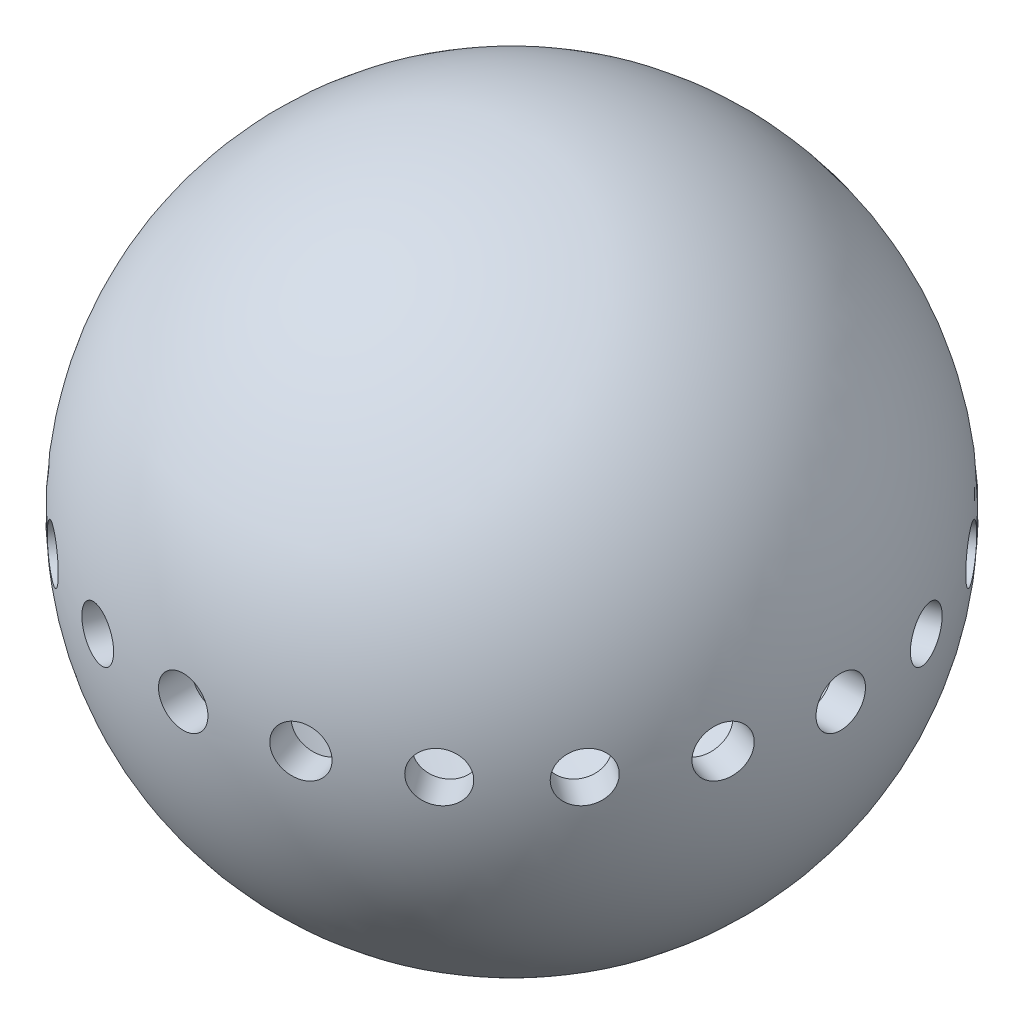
from build123d import *

# Parameters (mm, degrees)
CUT_EXTRUDE1_START = 17
SKETCH2_R          = 1.5
CUT_EXTRUDE1_DEPTH = 10
CIRPATTERN1_COUNT  = 20


with BuildPart() as part:
    # Sketch1 → Revolve1 (revolve)
    with BuildSketch(Plane.XY):
        with BuildLine():
            Line((0, 18), (0, 20))
            ThreePointArc((0, 20), (20, 0), (0, -20))
            Line((0, -20), (0, -18))
            ThreePointArc((0, -18), (18, 0), (0, 18))
        make_face()
    revolve(axis=Axis((0, 18, 0), (0, -1, 0)))

    # Sketch2 → Cut-Extrude1 (cut)
    with BuildSketch(Plane.XY.offset(CUT_EXTRUDE1_START)):
        with Locations(Location((0, 0, 0), (0, 0, 180))):
            Circle(SKETCH2_R)
    cut_extrude1 = extrude(amount=CUT_EXTRUDE1_DEPTH, mode=Mode.SUBTRACT)

    # CirPattern1: Cut-Extrude1 ×20 about axis
    cirpattern1_axis = Axis((0, 22, 0), (0, -1, 0))
    for i in range(1, CIRPATTERN1_COUNT):
        add(cut_extrude1.rotate(cirpattern1_axis, i * 360 / CIRPATTERN1_COUNT), mode=Mode.SUBTRACT)


solid = part.part
